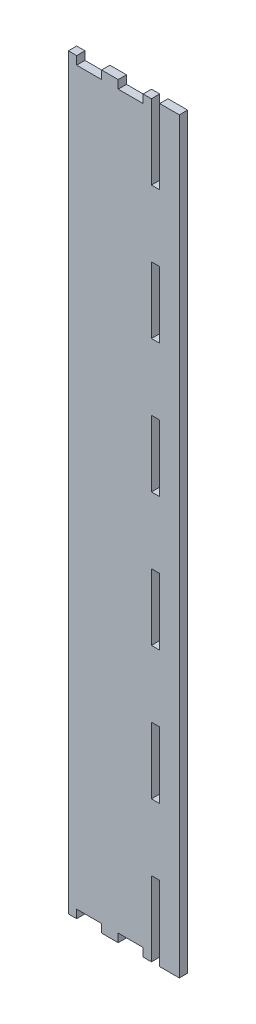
ISO-10303-21;
HEADER;
FILE_DESCRIPTION(('STEP AP214'),'2;1');
FILE_NAME('part.step','',(''),(''),'','','');
FILE_SCHEMA(('AUTOMOTIVE_DESIGN { 1 0 10303 214 1 1 1 1 }'));
ENDSEC;
DATA;
#1=APPLICATION_CONTEXT('core data for automotive mechanical design processes');
#2=APPLICATION_PROTOCOL_DEFINITION('international standard','automotive_design',2000,#1);
#3=PRODUCT_CONTEXT('',#1,'mechanical');
#4=PRODUCT('Part','Part','',(#3));
#5=PRODUCT_RELATED_PRODUCT_CATEGORY('part','',(#4));
#6=PRODUCT_DEFINITION_FORMATION('','',#4);
#7=PRODUCT_DEFINITION_CONTEXT('part definition',#1,'design');
#8=PRODUCT_DEFINITION('design','',#6,#7);
#9=PRODUCT_DEFINITION_SHAPE('','',#8);
#10=(LENGTH_UNIT() NAMED_UNIT(*) SI_UNIT(.MILLI.,.METRE.));
#11=(NAMED_UNIT(*) PLANE_ANGLE_UNIT() SI_UNIT($,.RADIAN.));
#12=(NAMED_UNIT(*) SI_UNIT($,.STERADIAN.) SOLID_ANGLE_UNIT());
#13=UNCERTAINTY_MEASURE_WITH_UNIT(LENGTH_MEASURE(1.E-05),#10,'distance_accuracy_value','');
#14=(GEOMETRIC_REPRESENTATION_CONTEXT(3) GLOBAL_UNCERTAINTY_ASSIGNED_CONTEXT((#13)) GLOBAL_UNIT_ASSIGNED_CONTEXT((#10,
#11,#12)) REPRESENTATION_CONTEXT('',''));
#15=CARTESIAN_POINT('',(0.,0.,0.));
#16=DIRECTION('',(0.,0.,1.));
#17=DIRECTION('',(1.,0.,0.));
#18=AXIS2_PLACEMENT_3D('',#15,#16,#17);
#19=CARTESIAN_POINT('',(0.,0.,5.));
#20=DIRECTION('',(0.,0.,-1.));
#21=DIRECTION('',(-1.,0.,0.));
#22=AXIS2_PLACEMENT_3D('',#19,#20,#21);
#23=PLANE('',#22);
#24=DIRECTION('',(-1.,0.,0.));
#25=VECTOR('',#24,1.);
#26=CARTESIAN_POINT('',(191.6856945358,41.341782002,5.));
#27=LINE('',#26,#25);
#28=CARTESIAN_POINT('',(191.6856945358,41.341782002,5.));
#29=VERTEX_POINT('',#28);
#30=CARTESIAN_POINT('',(186.6856945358,41.341782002,5.));
#31=VERTEX_POINT('',#30);
#32=EDGE_CURVE('E373',#29,#31,#27,.T.);
#33=ORIENTED_EDGE('',*,*,#32,.F.);
#34=DIRECTION('',(0.,1.,0.));
#35=VECTOR('',#34,1.);
#36=CARTESIAN_POINT('',(191.6856945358,1.341782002,5.));
#37=LINE('',#36,#35);
#38=CARTESIAN_POINT('',(191.6856945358,1.341782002,5.));
#39=VERTEX_POINT('',#38);
#40=EDGE_CURVE('E384',#39,#29,#37,.T.);
#41=ORIENTED_EDGE('',*,*,#40,.F.);
#42=DIRECTION('',(1.,0.,0.));
#43=VECTOR('',#42,1.);
#44=CARTESIAN_POINT('',(186.6856945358,1.341782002,5.));
#45=LINE('',#44,#43);
#46=CARTESIAN_POINT('',(186.6856945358,1.341782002,5.));
#47=VERTEX_POINT('',#46);
#48=EDGE_CURVE('E380',#47,#39,#45,.T.);
#49=ORIENTED_EDGE('',*,*,#48,.F.);
#50=DIRECTION('',(0.,-1.,0.));
#51=VECTOR('',#50,1.);
#52=CARTESIAN_POINT('',(186.6856945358,41.341782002,5.));
#53=LINE('',#52,#51);
#54=EDGE_CURVE('E376',#31,#47,#53,.T.);
#55=ORIENTED_EDGE('',*,*,#54,.F.);
#56=EDGE_LOOP('',(#33,#41,#49,#55));
#57=FACE_BOUND('',#56,.T.);
#58=DIRECTION('',(-1.,0.,0.));
#59=VECTOR('',#58,1.);
#60=CARTESIAN_POINT('',(191.6856945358,-118.658217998,5.));
#61=LINE('',#60,#59);
#62=CARTESIAN_POINT('',(191.6856945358,-118.658217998,5.));
#63=VERTEX_POINT('',#62);
#64=CARTESIAN_POINT('',(186.6856945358,-118.658217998,5.));
#65=VERTEX_POINT('',#64);
#66=EDGE_CURVE('E459',#63,#65,#61,.T.);
#67=ORIENTED_EDGE('',*,*,#66,.F.);
#68=DIRECTION('',(0.,1.,0.));
#69=VECTOR('',#68,1.);
#70=CARTESIAN_POINT('',(191.6856945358,-158.658217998,5.));
#71=LINE('',#70,#69);
#72=CARTESIAN_POINT('',(191.6856945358,-158.658217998,5.));
#73=VERTEX_POINT('',#72);
#74=EDGE_CURVE('E470',#73,#63,#71,.T.);
#75=ORIENTED_EDGE('',*,*,#74,.F.);
#76=DIRECTION('',(1.,0.,0.));
#77=VECTOR('',#76,1.);
#78=CARTESIAN_POINT('',(186.6856945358,-158.658217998,5.));
#79=LINE('',#78,#77);
#80=CARTESIAN_POINT('',(186.6856945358,-158.658217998,5.));
#81=VERTEX_POINT('',#80);
#82=EDGE_CURVE('E466',#81,#73,#79,.T.);
#83=ORIENTED_EDGE('',*,*,#82,.F.);
#84=DIRECTION('',(0.,-1.,0.));
#85=VECTOR('',#84,1.);
#86=CARTESIAN_POINT('',(186.6856945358,-118.658217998,5.));
#87=LINE('',#86,#85);
#88=EDGE_CURVE('E462',#65,#81,#87,.T.);
#89=ORIENTED_EDGE('',*,*,#88,.F.);
#90=EDGE_LOOP('',(#67,#75,#83,#89));
#91=FACE_BOUND('',#90,.T.);
#92=DIRECTION('',(1.,0.,0.));
#93=VECTOR('',#92,1.);
#94=CARTESIAN_POINT('',(166.6856945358,-243.658217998,5.));
#95=LINE('',#94,#93);
#96=CARTESIAN_POINT('',(156.6856945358,-243.658217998,5.));
#97=VERTEX_POINT('',#96);
#98=CARTESIAN_POINT('',(166.6856945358,-243.658217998,5.));
#99=VERTEX_POINT('',#98);
#100=EDGE_CURVE('E502',#97,#99,#95,.T.);
#101=ORIENTED_EDGE('',*,*,#100,.T.);
#102=DIRECTION('',(0.,1.,0.));
#103=VECTOR('',#102,1.);
#104=CARTESIAN_POINT('',(166.6856945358,-238.658217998,5.));
#105=LINE('',#104,#103);
#106=CARTESIAN_POINT('',(166.6856945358,-238.658217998,5.));
#107=VERTEX_POINT('',#106);
#108=EDGE_CURVE('E506',#99,#107,#105,.T.);
#109=ORIENTED_EDGE('',*,*,#108,.T.);
#110=DIRECTION('',(1.,0.,0.));
#111=VECTOR('',#110,1.);
#112=CARTESIAN_POINT('',(181.6856945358,-238.658217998,5.));
#113=LINE('',#112,#111);
#114=CARTESIAN_POINT('',(181.6856945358,-238.658217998,5.));
#115=VERTEX_POINT('',#114);
#116=EDGE_CURVE('E510',#107,#115,#113,.T.);
#117=ORIENTED_EDGE('',*,*,#116,.T.);
#118=DIRECTION('',(0.,-1.,0.));
#119=VECTOR('',#118,1.);
#120=CARTESIAN_POINT('',(181.6856945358,-243.658217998,5.));
#121=LINE('',#120,#119);
#122=CARTESIAN_POINT('',(181.6856945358,-243.658217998,5.));
#123=VERTEX_POINT('',#122);
#124=EDGE_CURVE('E513',#115,#123,#121,.T.);
#125=ORIENTED_EDGE('',*,*,#124,.T.);
#126=DIRECTION('',(1.,0.,0.));
#127=VECTOR('',#126,1.);
#128=CARTESIAN_POINT('',(186.6856945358,-243.658217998,5.));
#129=LINE('',#128,#127);
#130=CARTESIAN_POINT('',(186.6856945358,-243.658217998,5.));
#131=VERTEX_POINT('',#130);
#132=EDGE_CURVE('E516',#123,#131,#129,.T.);
#133=ORIENTED_EDGE('',*,*,#132,.T.);
#134=DIRECTION('',(0.,1.,0.));
#135=VECTOR('',#134,1.);
#136=CARTESIAN_POINT('',(186.6856945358,-198.658217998,5.));
#137=LINE('',#136,#135);
#138=CARTESIAN_POINT('',(186.6856945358,-198.658217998,5.));
#139=VERTEX_POINT('',#138);
#140=EDGE_CURVE('E519',#131,#139,#137,.T.);
#141=ORIENTED_EDGE('',*,*,#140,.T.);
#142=DIRECTION('',(1.,0.,0.));
#143=VECTOR('',#142,1.);
#144=CARTESIAN_POINT('',(191.6856945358,-198.658217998,5.));
#145=LINE('',#144,#143);
#146=CARTESIAN_POINT('',(191.6856945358,-198.658217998,5.));
#147=VERTEX_POINT('',#146);
#148=EDGE_CURVE('E522',#139,#147,#145,.T.);
#149=ORIENTED_EDGE('',*,*,#148,.T.);
#150=DIRECTION('',(0.,-1.,0.));
#151=VECTOR('',#150,1.);
#152=CARTESIAN_POINT('',(191.6856945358,-243.658217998,5.));
#153=LINE('',#152,#151);
#154=CARTESIAN_POINT('',(191.6856945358,-243.658217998,5.));
#155=VERTEX_POINT('',#154);
#156=EDGE_CURVE('E525',#147,#155,#153,.T.);
#157=ORIENTED_EDGE('',*,*,#156,.T.);
#158=DIRECTION('',(1.,0.,0.));
#159=VECTOR('',#158,1.);
#160=CARTESIAN_POINT('',(203.4867181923,-243.658217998,5.));
#161=LINE('',#160,#159);
#162=CARTESIAN_POINT('',(203.4867181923,-243.658217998,5.));
#163=VERTEX_POINT('',#162);
#164=EDGE_CURVE('E528',#155,#163,#161,.T.);
#165=ORIENTED_EDGE('',*,*,#164,.T.);
#166=DIRECTION('',(0.,1.,0.));
#167=VECTOR('',#166,1.);
#168=CARTESIAN_POINT('',(203.4867181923,206.341782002,5.));
#169=LINE('',#168,#167);
#170=CARTESIAN_POINT('',(203.4867181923,206.341782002,5.));
#171=VERTEX_POINT('',#170);
#172=EDGE_CURVE('E531',#163,#171,#169,.T.);
#173=ORIENTED_EDGE('',*,*,#172,.T.);
#174=DIRECTION('',(-1.,0.,0.));
#175=VECTOR('',#174,1.);
#176=CARTESIAN_POINT('',(203.4867181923,206.341782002,5.));
#177=LINE('',#176,#175);
#178=CARTESIAN_POINT('',(191.6856945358,206.341782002,5.));
#179=VERTEX_POINT('',#178);
#180=EDGE_CURVE('E534',#171,#179,#177,.T.);
#181=ORIENTED_EDGE('',*,*,#180,.T.);
#182=DIRECTION('',(0.,-1.,0.));
#183=VECTOR('',#182,1.);
#184=CARTESIAN_POINT('',(191.6856945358,161.341782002,5.));
#185=LINE('',#184,#183);
#186=CARTESIAN_POINT('',(191.6856945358,161.341782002,5.));
#187=VERTEX_POINT('',#186);
#188=EDGE_CURVE('E537',#179,#187,#185,.T.);
#189=ORIENTED_EDGE('',*,*,#188,.T.);
#190=DIRECTION('',(-1.,0.,0.));
#191=VECTOR('',#190,1.);
#192=CARTESIAN_POINT('',(186.6856945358,161.341782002,5.));
#193=LINE('',#192,#191);
#194=CARTESIAN_POINT('',(186.6856945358,161.341782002,5.));
#195=VERTEX_POINT('',#194);
#196=EDGE_CURVE('E540',#187,#195,#193,.T.);
#197=ORIENTED_EDGE('',*,*,#196,.T.);
#198=DIRECTION('',(0.,1.,0.));
#199=VECTOR('',#198,1.);
#200=CARTESIAN_POINT('',(186.6856945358,161.341782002,5.));
#201=LINE('',#200,#199);
#202=CARTESIAN_POINT('',(186.6856945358,206.341782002,5.));
#203=VERTEX_POINT('',#202);
#204=EDGE_CURVE('E543',#195,#203,#201,.T.);
#205=ORIENTED_EDGE('',*,*,#204,.T.);
#206=DIRECTION('',(-1.,0.,0.));
#207=VECTOR('',#206,1.);
#208=CARTESIAN_POINT('',(186.6856945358,206.341782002,5.));
#209=LINE('',#208,#207);
#210=CARTESIAN_POINT('',(181.6856945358,206.341782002,5.));
#211=VERTEX_POINT('',#210);
#212=EDGE_CURVE('E546',#203,#211,#209,.T.);
#213=ORIENTED_EDGE('',*,*,#212,.T.);
#214=DIRECTION('',(0.,-1.,0.));
#215=VECTOR('',#214,1.);
#216=CARTESIAN_POINT('',(181.6856945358,206.341782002,5.));
#217=LINE('',#216,#215);
#218=CARTESIAN_POINT('',(181.6856945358,201.341782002,5.));
#219=VERTEX_POINT('',#218);
#220=EDGE_CURVE('E549',#211,#219,#217,.T.);
#221=ORIENTED_EDGE('',*,*,#220,.T.);
#222=DIRECTION('',(-1.,0.,0.));
#223=VECTOR('',#222,1.);
#224=CARTESIAN_POINT('',(166.6856945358,201.341782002,5.));
#225=LINE('',#224,#223);
#226=CARTESIAN_POINT('',(166.6856945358,201.341782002,5.));
#227=VERTEX_POINT('',#226);
#228=EDGE_CURVE('E552',#219,#227,#225,.T.);
#229=ORIENTED_EDGE('',*,*,#228,.T.);
#230=DIRECTION('',(0.,1.,0.));
#231=VECTOR('',#230,1.);
#232=CARTESIAN_POINT('',(166.6856945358,201.341782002,5.));
#233=LINE('',#232,#231);
#234=CARTESIAN_POINT('',(166.6856945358,206.341782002,5.));
#235=VERTEX_POINT('',#234);
#236=EDGE_CURVE('E555',#227,#235,#233,.T.);
#237=ORIENTED_EDGE('',*,*,#236,.T.);
#238=DIRECTION('',(-1.,0.,0.));
#239=VECTOR('',#238,1.);
#240=CARTESIAN_POINT('',(166.6856945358,206.341782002,5.));
#241=LINE('',#240,#239);
#242=CARTESIAN_POINT('',(156.6856945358,206.341782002,5.));
#243=VERTEX_POINT('',#242);
#244=EDGE_CURVE('E558',#235,#243,#241,.T.);
#245=ORIENTED_EDGE('',*,*,#244,.T.);
#246=DIRECTION('',(0.,-1.,0.));
#247=VECTOR('',#246,1.);
#248=CARTESIAN_POINT('',(156.6856945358,206.341782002,5.));
#249=LINE('',#248,#247);
#250=CARTESIAN_POINT('',(156.6856945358,201.341782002,5.));
#251=VERTEX_POINT('',#250);
#252=EDGE_CURVE('E561',#243,#251,#249,.T.);
#253=ORIENTED_EDGE('',*,*,#252,.T.);
#254=DIRECTION('',(-1.,0.,0.));
#255=VECTOR('',#254,1.);
#256=CARTESIAN_POINT('',(156.6856945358,201.341782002,5.));
#257=LINE('',#256,#255);
#258=CARTESIAN_POINT('',(141.6856945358,201.341782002,5.));
#259=VERTEX_POINT('',#258);
#260=EDGE_CURVE('E564',#251,#259,#257,.T.);
#261=ORIENTED_EDGE('',*,*,#260,.T.);
#262=DIRECTION('',(0.,1.,0.));
#263=VECTOR('',#262,1.);
#264=CARTESIAN_POINT('',(141.6856945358,201.341782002,5.));
#265=LINE('',#264,#263);
#266=CARTESIAN_POINT('',(141.6856945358,206.341782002,5.));
#267=VERTEX_POINT('',#266);
#268=EDGE_CURVE('E567',#259,#267,#265,.T.);
#269=ORIENTED_EDGE('',*,*,#268,.T.);
#270=DIRECTION('',(-1.,0.,0.));
#271=VECTOR('',#270,1.);
#272=CARTESIAN_POINT('',(141.6856945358,206.341782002,5.));
#273=LINE('',#272,#271);
#274=CARTESIAN_POINT('',(136.6856945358,206.341782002,5.));
#275=VERTEX_POINT('',#274);
#276=EDGE_CURVE('E570',#267,#275,#273,.T.);
#277=ORIENTED_EDGE('',*,*,#276,.T.);
#278=DIRECTION('',(0.,-1.,0.));
#279=VECTOR('',#278,1.);
#280=CARTESIAN_POINT('',(136.6856945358,206.341782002,5.));
#281=LINE('',#280,#279);
#282=CARTESIAN_POINT('',(136.6856945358,-243.658217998,5.));
#283=VERTEX_POINT('',#282);
#284=EDGE_CURVE('E573',#275,#283,#281,.T.);
#285=ORIENTED_EDGE('',*,*,#284,.T.);
#286=DIRECTION('',(1.,0.,0.));
#287=VECTOR('',#286,1.);
#288=CARTESIAN_POINT('',(141.6856945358,-243.658217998,5.));
#289=LINE('',#288,#287);
#290=CARTESIAN_POINT('',(141.6856945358,-243.658217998,5.));
#291=VERTEX_POINT('',#290);
#292=EDGE_CURVE('E576',#283,#291,#289,.T.);
#293=ORIENTED_EDGE('',*,*,#292,.T.);
#294=DIRECTION('',(0.,1.,0.));
#295=VECTOR('',#294,1.);
#296=CARTESIAN_POINT('',(141.6856945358,-238.658217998,5.));
#297=LINE('',#296,#295);
#298=CARTESIAN_POINT('',(141.6856945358,-238.658217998,5.));
#299=VERTEX_POINT('',#298);
#300=EDGE_CURVE('E579',#291,#299,#297,.T.);
#301=ORIENTED_EDGE('',*,*,#300,.T.);
#302=DIRECTION('',(1.,0.,0.));
#303=VECTOR('',#302,1.);
#304=CARTESIAN_POINT('',(156.6856945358,-238.658217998,5.));
#305=LINE('',#304,#303);
#306=CARTESIAN_POINT('',(156.6856945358,-238.658217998,5.));
#307=VERTEX_POINT('',#306);
#308=EDGE_CURVE('E582',#299,#307,#305,.T.);
#309=ORIENTED_EDGE('',*,*,#308,.T.);
#310=DIRECTION('',(0.,-1.,0.));
#311=VECTOR('',#310,1.);
#312=CARTESIAN_POINT('',(156.6856945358,-243.658217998,5.));
#313=LINE('',#312,#311);
#314=EDGE_CURVE('E585',#307,#97,#313,.T.);
#315=ORIENTED_EDGE('',*,*,#314,.T.);
#316=EDGE_LOOP('',(#101,#109,#117,#125,#133,#141,#149,#157,#165,#173,#181,#189,#197,#205,#213,
#221,#229,#237,#245,#253,#261,#269,#277,#285,#293,#301,#309,#315));
#317=FACE_BOUND('',#316,.T.);
#318=DIRECTION('',(-1.,0.,0.));
#319=VECTOR('',#318,1.);
#320=CARTESIAN_POINT('',(191.6856945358,121.341782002,5.));
#321=LINE('',#320,#319);
#322=CARTESIAN_POINT('',(191.6856945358,121.341782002,5.));
#323=VERTEX_POINT('',#322);
#324=CARTESIAN_POINT('',(186.6856945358,121.341782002,5.));
#325=VERTEX_POINT('',#324);
#326=EDGE_CURVE('E416',#323,#325,#321,.T.);
#327=ORIENTED_EDGE('',*,*,#326,.F.);
#328=DIRECTION('',(0.,1.,0.));
#329=VECTOR('',#328,1.);
#330=CARTESIAN_POINT('',(191.6856945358,81.341782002,5.));
#331=LINE('',#330,#329);
#332=CARTESIAN_POINT('',(191.6856945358,81.341782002,5.));
#333=VERTEX_POINT('',#332);
#334=EDGE_CURVE('E427',#333,#323,#331,.T.);
#335=ORIENTED_EDGE('',*,*,#334,.F.);
#336=DIRECTION('',(1.,0.,0.));
#337=VECTOR('',#336,1.);
#338=CARTESIAN_POINT('',(186.6856945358,81.341782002,5.));
#339=LINE('',#338,#337);
#340=CARTESIAN_POINT('',(186.6856945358,81.341782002,5.));
#341=VERTEX_POINT('',#340);
#342=EDGE_CURVE('E423',#341,#333,#339,.T.);
#343=ORIENTED_EDGE('',*,*,#342,.F.);
#344=DIRECTION('',(0.,-1.,0.));
#345=VECTOR('',#344,1.);
#346=CARTESIAN_POINT('',(186.6856945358,121.341782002,5.));
#347=LINE('',#346,#345);
#348=EDGE_CURVE('E419',#325,#341,#347,.T.);
#349=ORIENTED_EDGE('',*,*,#348,.F.);
#350=EDGE_LOOP('',(#327,#335,#343,#349));
#351=FACE_BOUND('',#350,.T.);
#352=DIRECTION('',(-1.,0.,0.));
#353=VECTOR('',#352,1.);
#354=CARTESIAN_POINT('',(191.6856945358,-38.658217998,5.));
#355=LINE('',#354,#353);
#356=CARTESIAN_POINT('',(191.6856945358,-38.658217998,5.));
#357=VERTEX_POINT('',#356);
#358=CARTESIAN_POINT('',(186.6856945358,-38.658217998,5.));
#359=VERTEX_POINT('',#358);
#360=EDGE_CURVE('E325',#357,#359,#355,.T.);
#361=ORIENTED_EDGE('',*,*,#360,.F.);
#362=DIRECTION('',(0.,1.,0.));
#363=VECTOR('',#362,1.);
#364=CARTESIAN_POINT('',(191.6856945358,-78.658217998,5.));
#365=LINE('',#364,#363);
#366=CARTESIAN_POINT('',(191.6856945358,-78.658217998,5.));
#367=VERTEX_POINT('',#366);
#368=EDGE_CURVE('E351',#367,#357,#365,.T.);
#369=ORIENTED_EDGE('',*,*,#368,.F.);
#370=DIRECTION('',(1.,0.,0.));
#371=VECTOR('',#370,1.);
#372=CARTESIAN_POINT('',(186.6856945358,-78.658217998,5.));
#373=LINE('',#372,#371);
#374=CARTESIAN_POINT('',(186.6856945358,-78.658217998,5.));
#375=VERTEX_POINT('',#374);
#376=EDGE_CURVE('E347',#375,#367,#373,.T.);
#377=ORIENTED_EDGE('',*,*,#376,.F.);
#378=DIRECTION('',(0.,-1.,0.));
#379=VECTOR('',#378,1.);
#380=CARTESIAN_POINT('',(186.6856945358,-38.658217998,5.));
#381=LINE('',#380,#379);
#382=EDGE_CURVE('E334',#359,#375,#381,.T.);
#383=ORIENTED_EDGE('',*,*,#382,.F.);
#384=EDGE_LOOP('',(#361,#369,#377,#383));
#385=FACE_BOUND('',#384,.T.);
#386=ADVANCED_FACE('F43',(#57,#91,#317,#351,#385),#23,.F.);
#387=CARTESIAN_POINT('',(0.,0.,0.));
#388=DIRECTION('',(0.,0.,-1.));
#389=DIRECTION('',(-1.,0.,0.));
#390=AXIS2_PLACEMENT_3D('',#387,#388,#389);
#391=PLANE('',#390);
#392=DIRECTION('',(1.,0.,0.));
#393=VECTOR('',#392,1.);
#394=CARTESIAN_POINT('',(166.6856945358,-243.658217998,0.));
#395=LINE('',#394,#393);
#396=CARTESIAN_POINT('',(156.6856945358,-243.658217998,0.));
#397=VERTEX_POINT('',#396);
#398=CARTESIAN_POINT('',(166.6856945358,-243.658217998,0.));
#399=VERTEX_POINT('',#398);
#400=EDGE_CURVE('E501',#397,#399,#395,.T.);
#401=ORIENTED_EDGE('',*,*,#400,.F.);
#402=DIRECTION('',(0.,-1.,0.));
#403=VECTOR('',#402,1.);
#404=CARTESIAN_POINT('',(156.6856945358,-243.658217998,0.));
#405=LINE('',#404,#403);
#406=CARTESIAN_POINT('',(156.6856945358,-238.658217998,0.));
#407=VERTEX_POINT('',#406);
#408=EDGE_CURVE('E507',#407,#397,#405,.T.);
#409=ORIENTED_EDGE('',*,*,#408,.F.);
#410=DIRECTION('',(1.,0.,0.));
#411=VECTOR('',#410,1.);
#412=CARTESIAN_POINT('',(156.6856945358,-238.658217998,0.));
#413=LINE('',#412,#411);
#414=CARTESIAN_POINT('',(141.6856945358,-238.658217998,0.));
#415=VERTEX_POINT('',#414);
#416=EDGE_CURVE('E667',#415,#407,#413,.T.);
#417=ORIENTED_EDGE('',*,*,#416,.F.);
#418=DIRECTION('',(0.,1.,0.));
#419=VECTOR('',#418,1.);
#420=CARTESIAN_POINT('',(141.6856945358,-238.658217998,0.));
#421=LINE('',#420,#419);
#422=CARTESIAN_POINT('',(141.6856945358,-243.658217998,0.));
#423=VERTEX_POINT('',#422);
#424=EDGE_CURVE('E664',#423,#415,#421,.T.);
#425=ORIENTED_EDGE('',*,*,#424,.F.);
#426=DIRECTION('',(1.,0.,0.));
#427=VECTOR('',#426,1.);
#428=CARTESIAN_POINT('',(141.6856945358,-243.658217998,0.));
#429=LINE('',#428,#427);
#430=CARTESIAN_POINT('',(136.6856945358,-243.658217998,0.));
#431=VERTEX_POINT('',#430);
#432=EDGE_CURVE('E661',#431,#423,#429,.T.);
#433=ORIENTED_EDGE('',*,*,#432,.F.);
#434=DIRECTION('',(0.,-1.,0.));
#435=VECTOR('',#434,1.);
#436=CARTESIAN_POINT('',(136.6856945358,206.341782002,0.));
#437=LINE('',#436,#435);
#438=CARTESIAN_POINT('',(136.6856945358,206.341782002,0.));
#439=VERTEX_POINT('',#438);
#440=EDGE_CURVE('E658',#439,#431,#437,.T.);
#441=ORIENTED_EDGE('',*,*,#440,.F.);
#442=DIRECTION('',(-1.,0.,0.));
#443=VECTOR('',#442,1.);
#444=CARTESIAN_POINT('',(141.6856945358,206.341782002,0.));
#445=LINE('',#444,#443);
#446=CARTESIAN_POINT('',(141.6856945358,206.341782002,0.));
#447=VERTEX_POINT('',#446);
#448=EDGE_CURVE('E655',#447,#439,#445,.T.);
#449=ORIENTED_EDGE('',*,*,#448,.F.);
#450=DIRECTION('',(0.,1.,0.));
#451=VECTOR('',#450,1.);
#452=CARTESIAN_POINT('',(141.6856945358,201.341782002,0.));
#453=LINE('',#452,#451);
#454=CARTESIAN_POINT('',(141.6856945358,201.341782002,0.));
#455=VERTEX_POINT('',#454);
#456=EDGE_CURVE('E652',#455,#447,#453,.T.);
#457=ORIENTED_EDGE('',*,*,#456,.F.);
#458=DIRECTION('',(-1.,0.,0.));
#459=VECTOR('',#458,1.);
#460=CARTESIAN_POINT('',(156.6856945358,201.341782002,0.));
#461=LINE('',#460,#459);
#462=CARTESIAN_POINT('',(156.6856945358,201.341782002,0.));
#463=VERTEX_POINT('',#462);
#464=EDGE_CURVE('E649',#463,#455,#461,.T.);
#465=ORIENTED_EDGE('',*,*,#464,.F.);
#466=DIRECTION('',(0.,-1.,0.));
#467=VECTOR('',#466,1.);
#468=CARTESIAN_POINT('',(156.6856945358,206.341782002,0.));
#469=LINE('',#468,#467);
#470=CARTESIAN_POINT('',(156.6856945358,206.341782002,0.));
#471=VERTEX_POINT('',#470);
#472=EDGE_CURVE('E646',#471,#463,#469,.T.);
#473=ORIENTED_EDGE('',*,*,#472,.F.);
#474=DIRECTION('',(-1.,0.,0.));
#475=VECTOR('',#474,1.);
#476=CARTESIAN_POINT('',(166.6856945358,206.341782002,0.));
#477=LINE('',#476,#475);
#478=CARTESIAN_POINT('',(166.6856945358,206.341782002,0.));
#479=VERTEX_POINT('',#478);
#480=EDGE_CURVE('E643',#479,#471,#477,.T.);
#481=ORIENTED_EDGE('',*,*,#480,.F.);
#482=DIRECTION('',(0.,1.,0.));
#483=VECTOR('',#482,1.);
#484=CARTESIAN_POINT('',(166.6856945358,201.341782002,0.));
#485=LINE('',#484,#483);
#486=CARTESIAN_POINT('',(166.6856945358,201.341782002,0.));
#487=VERTEX_POINT('',#486);
#488=EDGE_CURVE('E640',#487,#479,#485,.T.);
#489=ORIENTED_EDGE('',*,*,#488,.F.);
#490=DIRECTION('',(-1.,0.,0.));
#491=VECTOR('',#490,1.);
#492=CARTESIAN_POINT('',(166.6856945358,201.341782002,0.));
#493=LINE('',#492,#491);
#494=CARTESIAN_POINT('',(181.6856945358,201.341782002,0.));
#495=VERTEX_POINT('',#494);
#496=EDGE_CURVE('E637',#495,#487,#493,.T.);
#497=ORIENTED_EDGE('',*,*,#496,.F.);
#498=DIRECTION('',(0.,-1.,0.));
#499=VECTOR('',#498,1.);
#500=CARTESIAN_POINT('',(181.6856945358,206.341782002,0.));
#501=LINE('',#500,#499);
#502=CARTESIAN_POINT('',(181.6856945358,206.341782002,0.));
#503=VERTEX_POINT('',#502);
#504=EDGE_CURVE('E634',#503,#495,#501,.T.);
#505=ORIENTED_EDGE('',*,*,#504,.F.);
#506=DIRECTION('',(-1.,0.,0.));
#507=VECTOR('',#506,1.);
#508=CARTESIAN_POINT('',(186.6856945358,206.341782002,0.));
#509=LINE('',#508,#507);
#510=CARTESIAN_POINT('',(186.6856945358,206.341782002,0.));
#511=VERTEX_POINT('',#510);
#512=EDGE_CURVE('E631',#511,#503,#509,.T.);
#513=ORIENTED_EDGE('',*,*,#512,.F.);
#514=DIRECTION('',(0.,1.,0.));
#515=VECTOR('',#514,1.);
#516=CARTESIAN_POINT('',(186.6856945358,161.341782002,0.));
#517=LINE('',#516,#515);
#518=CARTESIAN_POINT('',(186.6856945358,161.341782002,0.));
#519=VERTEX_POINT('',#518);
#520=EDGE_CURVE('E628',#519,#511,#517,.T.);
#521=ORIENTED_EDGE('',*,*,#520,.F.);
#522=DIRECTION('',(-1.,0.,0.));
#523=VECTOR('',#522,1.);
#524=CARTESIAN_POINT('',(186.6856945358,161.341782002,0.));
#525=LINE('',#524,#523);
#526=CARTESIAN_POINT('',(191.6856945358,161.341782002,0.));
#527=VERTEX_POINT('',#526);
#528=EDGE_CURVE('E625',#527,#519,#525,.T.);
#529=ORIENTED_EDGE('',*,*,#528,.F.);
#530=DIRECTION('',(0.,-1.,0.));
#531=VECTOR('',#530,1.);
#532=CARTESIAN_POINT('',(191.6856945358,161.341782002,0.));
#533=LINE('',#532,#531);
#534=CARTESIAN_POINT('',(191.6856945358,206.341782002,0.));
#535=VERTEX_POINT('',#534);
#536=EDGE_CURVE('E622',#535,#527,#533,.T.);
#537=ORIENTED_EDGE('',*,*,#536,.F.);
#538=DIRECTION('',(-1.,0.,0.));
#539=VECTOR('',#538,1.);
#540=CARTESIAN_POINT('',(203.4867181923,206.341782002,0.));
#541=LINE('',#540,#539);
#542=CARTESIAN_POINT('',(203.4867181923,206.341782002,0.));
#543=VERTEX_POINT('',#542);
#544=EDGE_CURVE('E619',#543,#535,#541,.T.);
#545=ORIENTED_EDGE('',*,*,#544,.F.);
#546=DIRECTION('',(0.,1.,0.));
#547=VECTOR('',#546,1.);
#548=CARTESIAN_POINT('',(203.4867181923,206.341782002,0.));
#549=LINE('',#548,#547);
#550=CARTESIAN_POINT('',(203.4867181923,-243.658217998,0.));
#551=VERTEX_POINT('',#550);
#552=EDGE_CURVE('E616',#551,#543,#549,.T.);
#553=ORIENTED_EDGE('',*,*,#552,.F.);
#554=DIRECTION('',(1.,0.,0.));
#555=VECTOR('',#554,1.);
#556=CARTESIAN_POINT('',(203.4867181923,-243.658217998,0.));
#557=LINE('',#556,#555);
#558=CARTESIAN_POINT('',(191.6856945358,-243.658217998,0.));
#559=VERTEX_POINT('',#558);
#560=EDGE_CURVE('E613',#559,#551,#557,.T.);
#561=ORIENTED_EDGE('',*,*,#560,.F.);
#562=DIRECTION('',(0.,-1.,0.));
#563=VECTOR('',#562,1.);
#564=CARTESIAN_POINT('',(191.6856945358,-243.658217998,0.));
#565=LINE('',#564,#563);
#566=CARTESIAN_POINT('',(191.6856945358,-198.658217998,0.));
#567=VERTEX_POINT('',#566);
#568=EDGE_CURVE('E610',#567,#559,#565,.T.);
#569=ORIENTED_EDGE('',*,*,#568,.F.);
#570=DIRECTION('',(1.,0.,0.));
#571=VECTOR('',#570,1.);
#572=CARTESIAN_POINT('',(191.6856945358,-198.658217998,0.));
#573=LINE('',#572,#571);
#574=CARTESIAN_POINT('',(186.6856945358,-198.658217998,0.));
#575=VERTEX_POINT('',#574);
#576=EDGE_CURVE('E607',#575,#567,#573,.T.);
#577=ORIENTED_EDGE('',*,*,#576,.F.);
#578=DIRECTION('',(0.,1.,0.));
#579=VECTOR('',#578,1.);
#580=CARTESIAN_POINT('',(186.6856945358,-198.658217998,0.));
#581=LINE('',#580,#579);
#582=CARTESIAN_POINT('',(186.6856945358,-243.658217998,0.));
#583=VERTEX_POINT('',#582);
#584=EDGE_CURVE('E604',#583,#575,#581,.T.);
#585=ORIENTED_EDGE('',*,*,#584,.F.);
#586=DIRECTION('',(1.,0.,0.));
#587=VECTOR('',#586,1.);
#588=CARTESIAN_POINT('',(186.6856945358,-243.658217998,0.));
#589=LINE('',#588,#587);
#590=CARTESIAN_POINT('',(181.6856945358,-243.658217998,0.));
#591=VERTEX_POINT('',#590);
#592=EDGE_CURVE('E601',#591,#583,#589,.T.);
#593=ORIENTED_EDGE('',*,*,#592,.F.);
#594=DIRECTION('',(0.,-1.,0.));
#595=VECTOR('',#594,1.);
#596=CARTESIAN_POINT('',(181.6856945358,-243.658217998,0.));
#597=LINE('',#596,#595);
#598=CARTESIAN_POINT('',(181.6856945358,-238.658217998,0.));
#599=VERTEX_POINT('',#598);
#600=EDGE_CURVE('E598',#599,#591,#597,.T.);
#601=ORIENTED_EDGE('',*,*,#600,.F.);
#602=DIRECTION('',(1.,0.,0.));
#603=VECTOR('',#602,1.);
#604=CARTESIAN_POINT('',(181.6856945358,-238.658217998,0.));
#605=LINE('',#604,#603);
#606=CARTESIAN_POINT('',(166.6856945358,-238.658217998,0.));
#607=VERTEX_POINT('',#606);
#608=EDGE_CURVE('E595',#607,#599,#605,.T.);
#609=ORIENTED_EDGE('',*,*,#608,.F.);
#610=DIRECTION('',(0.,1.,0.));
#611=VECTOR('',#610,1.);
#612=CARTESIAN_POINT('',(166.6856945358,-238.658217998,0.));
#613=LINE('',#612,#611);
#614=EDGE_CURVE('E592',#399,#607,#613,.T.);
#615=ORIENTED_EDGE('',*,*,#614,.F.);
#616=EDGE_LOOP('',(#401,#409,#417,#425,#433,#441,#449,#457,#465,#473,#481,#489,#497,#505,#513,
#521,#529,#537,#545,#553,#561,#569,#577,#585,#593,#601,#609,#615));
#617=FACE_BOUND('',#616,.T.);
#618=DIRECTION('',(0.,1.,0.));
#619=VECTOR('',#618,1.);
#620=CARTESIAN_POINT('',(191.6856945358,-158.658217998,0.));
#621=LINE('',#620,#619);
#622=CARTESIAN_POINT('',(191.6856945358,-158.658217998,0.));
#623=VERTEX_POINT('',#622);
#624=CARTESIAN_POINT('',(191.6856945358,-118.658217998,0.));
#625=VERTEX_POINT('',#624);
#626=EDGE_CURVE('E463',#623,#625,#621,.T.);
#627=ORIENTED_EDGE('',*,*,#626,.T.);
#628=DIRECTION('',(-1.,0.,0.));
#629=VECTOR('',#628,1.);
#630=CARTESIAN_POINT('',(191.6856945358,-118.658217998,0.));
#631=LINE('',#630,#629);
#632=CARTESIAN_POINT('',(186.6856945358,-118.658217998,0.));
#633=VERTEX_POINT('',#632);
#634=EDGE_CURVE('E458',#625,#633,#631,.T.);
#635=ORIENTED_EDGE('',*,*,#634,.T.);
#636=DIRECTION('',(0.,-1.,0.));
#637=VECTOR('',#636,1.);
#638=CARTESIAN_POINT('',(186.6856945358,-118.658217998,0.));
#639=LINE('',#638,#637);
#640=CARTESIAN_POINT('',(186.6856945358,-158.658217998,0.));
#641=VERTEX_POINT('',#640);
#642=EDGE_CURVE('E477',#633,#641,#639,.T.);
#643=ORIENTED_EDGE('',*,*,#642,.T.);
#644=DIRECTION('',(1.,0.,0.));
#645=VECTOR('',#644,1.);
#646=CARTESIAN_POINT('',(186.6856945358,-158.658217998,0.));
#647=LINE('',#646,#645);
#648=EDGE_CURVE('E481',#641,#623,#647,.T.);
#649=ORIENTED_EDGE('',*,*,#648,.T.);
#650=EDGE_LOOP('',(#627,#635,#643,#649));
#651=FACE_BOUND('',#650,.T.);
#652=DIRECTION('',(0.,1.,0.));
#653=VECTOR('',#652,1.);
#654=CARTESIAN_POINT('',(191.6856945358,81.341782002,0.));
#655=LINE('',#654,#653);
#656=CARTESIAN_POINT('',(191.6856945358,81.341782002,0.));
#657=VERTEX_POINT('',#656);
#658=CARTESIAN_POINT('',(191.6856945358,121.341782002,0.));
#659=VERTEX_POINT('',#658);
#660=EDGE_CURVE('E420',#657,#659,#655,.T.);
#661=ORIENTED_EDGE('',*,*,#660,.T.);
#662=DIRECTION('',(-1.,0.,0.));
#663=VECTOR('',#662,1.);
#664=CARTESIAN_POINT('',(191.6856945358,121.341782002,0.));
#665=LINE('',#664,#663);
#666=CARTESIAN_POINT('',(186.6856945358,121.341782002,0.));
#667=VERTEX_POINT('',#666);
#668=EDGE_CURVE('E415',#659,#667,#665,.T.);
#669=ORIENTED_EDGE('',*,*,#668,.T.);
#670=DIRECTION('',(0.,-1.,0.));
#671=VECTOR('',#670,1.);
#672=CARTESIAN_POINT('',(186.6856945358,121.341782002,0.));
#673=LINE('',#672,#671);
#674=CARTESIAN_POINT('',(186.6856945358,81.341782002,0.));
#675=VERTEX_POINT('',#674);
#676=EDGE_CURVE('E434',#667,#675,#673,.T.);
#677=ORIENTED_EDGE('',*,*,#676,.T.);
#678=DIRECTION('',(1.,0.,0.));
#679=VECTOR('',#678,1.);
#680=CARTESIAN_POINT('',(186.6856945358,81.341782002,0.));
#681=LINE('',#680,#679);
#682=EDGE_CURVE('E438',#675,#657,#681,.T.);
#683=ORIENTED_EDGE('',*,*,#682,.T.);
#684=EDGE_LOOP('',(#661,#669,#677,#683));
#685=FACE_BOUND('',#684,.T.);
#686=DIRECTION('',(0.,1.,0.));
#687=VECTOR('',#686,1.);
#688=CARTESIAN_POINT('',(191.6856945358,1.341782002,0.));
#689=LINE('',#688,#687);
#690=CARTESIAN_POINT('',(191.6856945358,1.341782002,0.));
#691=VERTEX_POINT('',#690);
#692=CARTESIAN_POINT('',(191.6856945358,41.341782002,0.));
#693=VERTEX_POINT('',#692);
#694=EDGE_CURVE('E377',#691,#693,#689,.T.);
#695=ORIENTED_EDGE('',*,*,#694,.T.);
#696=DIRECTION('',(-1.,0.,0.));
#697=VECTOR('',#696,1.);
#698=CARTESIAN_POINT('',(191.6856945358,41.341782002,0.));
#699=LINE('',#698,#697);
#700=CARTESIAN_POINT('',(186.6856945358,41.341782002,0.));
#701=VERTEX_POINT('',#700);
#702=EDGE_CURVE('E343',#693,#701,#699,.T.);
#703=ORIENTED_EDGE('',*,*,#702,.T.);
#704=DIRECTION('',(0.,-1.,0.));
#705=VECTOR('',#704,1.);
#706=CARTESIAN_POINT('',(186.6856945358,41.341782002,0.));
#707=LINE('',#706,#705);
#708=CARTESIAN_POINT('',(186.6856945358,1.341782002,0.));
#709=VERTEX_POINT('',#708);
#710=EDGE_CURVE('E391',#701,#709,#707,.T.);
#711=ORIENTED_EDGE('',*,*,#710,.T.);
#712=DIRECTION('',(1.,0.,0.));
#713=VECTOR('',#712,1.);
#714=CARTESIAN_POINT('',(186.6856945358,1.341782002,0.));
#715=LINE('',#714,#713);
#716=EDGE_CURVE('E395',#709,#691,#715,.T.);
#717=ORIENTED_EDGE('',*,*,#716,.T.);
#718=EDGE_LOOP('',(#695,#703,#711,#717));
#719=FACE_BOUND('',#718,.T.);
#720=DIRECTION('',(0.,1.,0.));
#721=VECTOR('',#720,1.);
#722=CARTESIAN_POINT('',(191.6856945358,-78.658217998,0.));
#723=LINE('',#722,#721);
#724=CARTESIAN_POINT('',(191.6856945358,-78.658217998,0.));
#725=VERTEX_POINT('',#724);
#726=CARTESIAN_POINT('',(191.6856945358,-38.658217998,0.));
#727=VERTEX_POINT('',#726);
#728=EDGE_CURVE('E335',#725,#727,#723,.T.);
#729=ORIENTED_EDGE('',*,*,#728,.T.);
#730=DIRECTION('',(-1.,0.,0.));
#731=VECTOR('',#730,1.);
#732=CARTESIAN_POINT('',(191.6856945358,-38.658217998,0.));
#733=LINE('',#732,#731);
#734=CARTESIAN_POINT('',(186.6856945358,-38.658217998,0.));
#735=VERTEX_POINT('',#734);
#736=EDGE_CURVE('E67',#727,#735,#733,.T.);
#737=ORIENTED_EDGE('',*,*,#736,.T.);
#738=DIRECTION('',(0.,-1.,0.));
#739=VECTOR('',#738,1.);
#740=CARTESIAN_POINT('',(186.6856945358,-38.658217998,0.));
#741=LINE('',#740,#739);
#742=CARTESIAN_POINT('',(186.6856945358,-78.658217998,0.));
#743=VERTEX_POINT('',#742);
#744=EDGE_CURVE('E341',#735,#743,#741,.T.);
#745=ORIENTED_EDGE('',*,*,#744,.T.);
#746=DIRECTION('',(1.,0.,0.));
#747=VECTOR('',#746,1.);
#748=CARTESIAN_POINT('',(186.6856945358,-78.658217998,0.));
#749=LINE('',#748,#747);
#750=EDGE_CURVE('E360',#743,#725,#749,.T.);
#751=ORIENTED_EDGE('',*,*,#750,.T.);
#752=EDGE_LOOP('',(#729,#737,#745,#751));
#753=FACE_BOUND('',#752,.T.);
#754=ADVANCED_FACE('F786',(#617,#651,#685,#719,#753),#391,.T.);
#755=CARTESIAN_POINT('',(166.6856945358,-243.658217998,5.));
#756=DIRECTION('',(0.,1.,0.));
#757=DIRECTION('',(0.,0.,1.));
#758=AXIS2_PLACEMENT_3D('',#755,#756,#757);
#759=PLANE('',#758);
#760=ORIENTED_EDGE('',*,*,#400,.T.);
#761=DIRECTION('',(0.,0.,-1.));
#762=VECTOR('',#761,1.);
#763=CARTESIAN_POINT('',(166.6856945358,-243.658217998,5.));
#764=LINE('',#763,#762);
#765=EDGE_CURVE('E11',#99,#399,#764,.T.);
#766=ORIENTED_EDGE('',*,*,#765,.F.);
#767=ORIENTED_EDGE('',*,*,#100,.F.);
#768=DIRECTION('',(0.,0.,-1.));
#769=VECTOR('',#768,1.);
#770=CARTESIAN_POINT('',(156.6856945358,-243.658217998,5.));
#771=LINE('',#770,#769);
#772=EDGE_CURVE('E588',#97,#397,#771,.T.);
#773=ORIENTED_EDGE('',*,*,#772,.T.);
#774=EDGE_LOOP('',(#760,#766,#767,#773));
#775=FACE_BOUND('',#774,.T.);
#776=ADVANCED_FACE('F45',(#775),#759,.F.);
#777=CARTESIAN_POINT('',(166.6856945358,-238.658217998,5.));
#778=DIRECTION('',(-1.,0.,0.));
#779=DIRECTION('',(0.,0.,1.));
#780=AXIS2_PLACEMENT_3D('',#777,#778,#779);
#781=PLANE('',#780);
#782=ORIENTED_EDGE('',*,*,#614,.T.);
#783=DIRECTION('',(0.,0.,-1.));
#784=VECTOR('',#783,1.);
#785=CARTESIAN_POINT('',(166.6856945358,-238.658217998,5.));
#786=LINE('',#785,#784);
#787=EDGE_CURVE('E52',#107,#607,#786,.T.);
#788=ORIENTED_EDGE('',*,*,#787,.F.);
#789=ORIENTED_EDGE('',*,*,#108,.F.);
#790=ORIENTED_EDGE('',*,*,#765,.T.);
#791=EDGE_LOOP('',(#782,#788,#789,#790));
#792=FACE_BOUND('',#791,.T.);
#793=ADVANCED_FACE('F804',(#792),#781,.F.);
#794=CARTESIAN_POINT('',(181.6856945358,-238.658217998,5.));
#795=DIRECTION('',(0.,1.,0.));
#796=DIRECTION('',(0.,0.,1.));
#797=AXIS2_PLACEMENT_3D('',#794,#795,#796);
#798=PLANE('',#797);
#799=ORIENTED_EDGE('',*,*,#608,.T.);
#800=DIRECTION('',(0.,0.,-1.));
#801=VECTOR('',#800,1.);
#802=CARTESIAN_POINT('',(181.6856945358,-238.658217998,5.));
#803=LINE('',#802,#801);
#804=EDGE_CURVE('E771',#115,#599,#803,.T.);
#805=ORIENTED_EDGE('',*,*,#804,.F.);
#806=ORIENTED_EDGE('',*,*,#116,.F.);
#807=ORIENTED_EDGE('',*,*,#787,.T.);
#808=EDGE_LOOP('',(#799,#805,#806,#807));
#809=FACE_BOUND('',#808,.T.);
#810=ADVANCED_FACE('F780',(#809),#798,.F.);
#811=CARTESIAN_POINT('',(181.6856945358,-243.658217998,5.));
#812=DIRECTION('',(1.,0.,0.));
#813=DIRECTION('',(0.,0.,-1.));
#814=AXIS2_PLACEMENT_3D('',#811,#812,#813);
#815=PLANE('',#814);
#816=ORIENTED_EDGE('',*,*,#600,.T.);
#817=DIRECTION('',(0.,0.,-1.));
#818=VECTOR('',#817,1.);
#819=CARTESIAN_POINT('',(181.6856945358,-243.658217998,5.));
#820=LINE('',#819,#818);
#821=EDGE_CURVE('E767',#123,#591,#820,.T.);
#822=ORIENTED_EDGE('',*,*,#821,.F.);
#823=ORIENTED_EDGE('',*,*,#124,.F.);
#824=ORIENTED_EDGE('',*,*,#804,.T.);
#825=EDGE_LOOP('',(#816,#822,#823,#824));
#826=FACE_BOUND('',#825,.T.);
#827=ADVANCED_FACE('F792',(#826),#815,.F.);
#828=CARTESIAN_POINT('',(186.6856945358,-243.658217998,5.));
#829=DIRECTION('',(0.,1.,0.));
#830=DIRECTION('',(0.,0.,1.));
#831=AXIS2_PLACEMENT_3D('',#828,#829,#830);
#832=PLANE('',#831);
#833=ORIENTED_EDGE('',*,*,#592,.T.);
#834=DIRECTION('',(0.,0.,-1.));
#835=VECTOR('',#834,1.);
#836=CARTESIAN_POINT('',(186.6856945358,-243.658217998,5.));
#837=LINE('',#836,#835);
#838=EDGE_CURVE('E763',#131,#583,#837,.T.);
#839=ORIENTED_EDGE('',*,*,#838,.F.);
#840=ORIENTED_EDGE('',*,*,#132,.F.);
#841=ORIENTED_EDGE('',*,*,#821,.T.);
#842=EDGE_LOOP('',(#833,#839,#840,#841));
#843=FACE_BOUND('',#842,.T.);
#844=ADVANCED_FACE('F796',(#843),#832,.F.);
#845=CARTESIAN_POINT('',(186.6856945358,-198.658217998,5.));
#846=DIRECTION('',(-1.,0.,0.));
#847=DIRECTION('',(0.,0.,1.));
#848=AXIS2_PLACEMENT_3D('',#845,#846,#847);
#849=PLANE('',#848);
#850=ORIENTED_EDGE('',*,*,#584,.T.);
#851=DIRECTION('',(0.,0.,-1.));
#852=VECTOR('',#851,1.);
#853=CARTESIAN_POINT('',(186.6856945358,-198.658217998,5.));
#854=LINE('',#853,#852);
#855=EDGE_CURVE('E759',#139,#575,#854,.T.);
#856=ORIENTED_EDGE('',*,*,#855,.F.);
#857=ORIENTED_EDGE('',*,*,#140,.F.);
#858=ORIENTED_EDGE('',*,*,#838,.T.);
#859=EDGE_LOOP('',(#850,#856,#857,#858));
#860=FACE_BOUND('',#859,.T.);
#861=ADVANCED_FACE('F917',(#860),#849,.F.);
#862=CARTESIAN_POINT('',(191.6856945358,-198.658217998,5.));
#863=DIRECTION('',(0.,1.,0.));
#864=DIRECTION('',(0.,0.,1.));
#865=AXIS2_PLACEMENT_3D('',#862,#863,#864);
#866=PLANE('',#865);
#867=ORIENTED_EDGE('',*,*,#576,.T.);
#868=DIRECTION('',(0.,0.,-1.));
#869=VECTOR('',#868,1.);
#870=CARTESIAN_POINT('',(191.6856945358,-198.658217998,5.));
#871=LINE('',#870,#869);
#872=EDGE_CURVE('E755',#147,#567,#871,.T.);
#873=ORIENTED_EDGE('',*,*,#872,.F.);
#874=ORIENTED_EDGE('',*,*,#148,.F.);
#875=ORIENTED_EDGE('',*,*,#855,.T.);
#876=EDGE_LOOP('',(#867,#873,#874,#875));
#877=FACE_BOUND('',#876,.T.);
#878=ADVANCED_FACE('F914',(#877),#866,.F.);
#879=CARTESIAN_POINT('',(191.6856945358,-243.658217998,5.));
#880=DIRECTION('',(1.,0.,0.));
#881=DIRECTION('',(0.,0.,-1.));
#882=AXIS2_PLACEMENT_3D('',#879,#880,#881);
#883=PLANE('',#882);
#884=ORIENTED_EDGE('',*,*,#568,.T.);
#885=DIRECTION('',(0.,0.,-1.));
#886=VECTOR('',#885,1.);
#887=CARTESIAN_POINT('',(191.6856945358,-243.658217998,5.));
#888=LINE('',#887,#886);
#889=EDGE_CURVE('E751',#155,#559,#888,.T.);
#890=ORIENTED_EDGE('',*,*,#889,.F.);
#891=ORIENTED_EDGE('',*,*,#156,.F.);
#892=ORIENTED_EDGE('',*,*,#872,.T.);
#893=EDGE_LOOP('',(#884,#890,#891,#892));
#894=FACE_BOUND('',#893,.T.);
#895=ADVANCED_FACE('F910',(#894),#883,.F.);
#896=CARTESIAN_POINT('',(203.4867181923,-243.658217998,5.));
#897=DIRECTION('',(0.,1.,0.));
#898=DIRECTION('',(0.,0.,1.));
#899=AXIS2_PLACEMENT_3D('',#896,#897,#898);
#900=PLANE('',#899);
#901=ORIENTED_EDGE('',*,*,#560,.T.);
#902=DIRECTION('',(0.,0.,-1.));
#903=VECTOR('',#902,1.);
#904=CARTESIAN_POINT('',(203.4867181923,-243.658217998,5.));
#905=LINE('',#904,#903);
#906=EDGE_CURVE('E747',#163,#551,#905,.T.);
#907=ORIENTED_EDGE('',*,*,#906,.F.);
#908=ORIENTED_EDGE('',*,*,#164,.F.);
#909=ORIENTED_EDGE('',*,*,#889,.T.);
#910=EDGE_LOOP('',(#901,#907,#908,#909));
#911=FACE_BOUND('',#910,.T.);
#912=ADVANCED_FACE('F906',(#911),#900,.F.);
#913=CARTESIAN_POINT('',(203.4867181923,206.341782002,5.));
#914=DIRECTION('',(-1.,0.,0.));
#915=DIRECTION('',(0.,0.,1.));
#916=AXIS2_PLACEMENT_3D('',#913,#914,#915);
#917=PLANE('',#916);
#918=ORIENTED_EDGE('',*,*,#552,.T.);
#919=DIRECTION('',(0.,0.,-1.));
#920=VECTOR('',#919,1.);
#921=CARTESIAN_POINT('',(203.4867181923,206.341782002,5.));
#922=LINE('',#921,#920);
#923=EDGE_CURVE('E743',#171,#543,#922,.T.);
#924=ORIENTED_EDGE('',*,*,#923,.F.);
#925=ORIENTED_EDGE('',*,*,#172,.F.);
#926=ORIENTED_EDGE('',*,*,#906,.T.);
#927=EDGE_LOOP('',(#918,#924,#925,#926));
#928=FACE_BOUND('',#927,.T.);
#929=ADVANCED_FACE('F901',(#928),#917,.F.);
#930=CARTESIAN_POINT('',(203.4867181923,206.341782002,5.));
#931=DIRECTION('',(0.,-1.,0.));
#932=DIRECTION('',(0.,0.,-1.));
#933=AXIS2_PLACEMENT_3D('',#930,#931,#932);
#934=PLANE('',#933);
#935=ORIENTED_EDGE('',*,*,#544,.T.);
#936=DIRECTION('',(0.,0.,-1.));
#937=VECTOR('',#936,1.);
#938=CARTESIAN_POINT('',(191.6856945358,206.341782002,5.));
#939=LINE('',#938,#937);
#940=EDGE_CURVE('E739',#179,#535,#939,.T.);
#941=ORIENTED_EDGE('',*,*,#940,.F.);
#942=ORIENTED_EDGE('',*,*,#180,.F.);
#943=ORIENTED_EDGE('',*,*,#923,.T.);
#944=EDGE_LOOP('',(#935,#941,#942,#943));
#945=FACE_BOUND('',#944,.T.);
#946=ADVANCED_FACE('F895',(#945),#934,.F.);
#947=CARTESIAN_POINT('',(191.6856945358,161.341782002,5.));
#948=DIRECTION('',(1.,0.,0.));
#949=DIRECTION('',(0.,0.,-1.));
#950=AXIS2_PLACEMENT_3D('',#947,#948,#949);
#951=PLANE('',#950);
#952=ORIENTED_EDGE('',*,*,#536,.T.);
#953=DIRECTION('',(0.,0.,-1.));
#954=VECTOR('',#953,1.);
#955=CARTESIAN_POINT('',(191.6856945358,161.341782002,5.));
#956=LINE('',#955,#954);
#957=EDGE_CURVE('E735',#187,#527,#956,.T.);
#958=ORIENTED_EDGE('',*,*,#957,.F.);
#959=ORIENTED_EDGE('',*,*,#188,.F.);
#960=ORIENTED_EDGE('',*,*,#940,.T.);
#961=EDGE_LOOP('',(#952,#958,#959,#960));
#962=FACE_BOUND('',#961,.T.);
#963=ADVANCED_FACE('F891',(#962),#951,.F.);
#964=CARTESIAN_POINT('',(186.6856945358,161.341782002,5.));
#965=DIRECTION('',(0.,-1.,0.));
#966=DIRECTION('',(0.,0.,-1.));
#967=AXIS2_PLACEMENT_3D('',#964,#965,#966);
#968=PLANE('',#967);
#969=ORIENTED_EDGE('',*,*,#528,.T.);
#970=DIRECTION('',(0.,0.,-1.));
#971=VECTOR('',#970,1.);
#972=CARTESIAN_POINT('',(186.6856945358,161.341782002,5.));
#973=LINE('',#972,#971);
#974=EDGE_CURVE('E731',#195,#519,#973,.T.);
#975=ORIENTED_EDGE('',*,*,#974,.F.);
#976=ORIENTED_EDGE('',*,*,#196,.F.);
#977=ORIENTED_EDGE('',*,*,#957,.T.);
#978=EDGE_LOOP('',(#969,#975,#976,#977));
#979=FACE_BOUND('',#978,.T.);
#980=ADVANCED_FACE('F886',(#979),#968,.F.);
#981=CARTESIAN_POINT('',(186.6856945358,161.341782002,5.));
#982=DIRECTION('',(-1.,0.,0.));
#983=DIRECTION('',(0.,0.,1.));
#984=AXIS2_PLACEMENT_3D('',#981,#982,#983);
#985=PLANE('',#984);
#986=ORIENTED_EDGE('',*,*,#520,.T.);
#987=DIRECTION('',(0.,0.,-1.));
#988=VECTOR('',#987,1.);
#989=CARTESIAN_POINT('',(186.6856945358,206.341782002,5.));
#990=LINE('',#989,#988);
#991=EDGE_CURVE('E727',#203,#511,#990,.T.);
#992=ORIENTED_EDGE('',*,*,#991,.F.);
#993=ORIENTED_EDGE('',*,*,#204,.F.);
#994=ORIENTED_EDGE('',*,*,#974,.T.);
#995=EDGE_LOOP('',(#986,#992,#993,#994));
#996=FACE_BOUND('',#995,.T.);
#997=ADVANCED_FACE('F880',(#996),#985,.F.);
#998=CARTESIAN_POINT('',(186.6856945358,206.341782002,5.));
#999=DIRECTION('',(0.,-1.,0.));
#1000=DIRECTION('',(0.,0.,-1.));
#1001=AXIS2_PLACEMENT_3D('',#998,#999,#1000);
#1002=PLANE('',#1001);
#1003=ORIENTED_EDGE('',*,*,#512,.T.);
#1004=DIRECTION('',(0.,0.,-1.));
#1005=VECTOR('',#1004,1.);
#1006=CARTESIAN_POINT('',(181.6856945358,206.341782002,5.));
#1007=LINE('',#1006,#1005);
#1008=EDGE_CURVE('E723',#211,#503,#1007,.T.);
#1009=ORIENTED_EDGE('',*,*,#1008,.F.);
#1010=ORIENTED_EDGE('',*,*,#212,.F.);
#1011=ORIENTED_EDGE('',*,*,#991,.T.);
#1012=EDGE_LOOP('',(#1003,#1009,#1010,#1011));
#1013=FACE_BOUND('',#1012,.T.);
#1014=ADVANCED_FACE('F876',(#1013),#1002,.F.);
#1015=CARTESIAN_POINT('',(181.6856945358,206.341782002,5.));
#1016=DIRECTION('',(1.,0.,0.));
#1017=DIRECTION('',(0.,0.,-1.));
#1018=AXIS2_PLACEMENT_3D('',#1015,#1016,#1017);
#1019=PLANE('',#1018);
#1020=ORIENTED_EDGE('',*,*,#504,.T.);
#1021=DIRECTION('',(0.,0.,-1.));
#1022=VECTOR('',#1021,1.);
#1023=CARTESIAN_POINT('',(181.6856945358,201.341782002,5.));
#1024=LINE('',#1023,#1022);
#1025=EDGE_CURVE('E719',#219,#495,#1024,.T.);
#1026=ORIENTED_EDGE('',*,*,#1025,.F.);
#1027=ORIENTED_EDGE('',*,*,#220,.F.);
#1028=ORIENTED_EDGE('',*,*,#1008,.T.);
#1029=EDGE_LOOP('',(#1020,#1026,#1027,#1028));
#1030=FACE_BOUND('',#1029,.T.);
#1031=ADVANCED_FACE('F871',(#1030),#1019,.F.);
#1032=CARTESIAN_POINT('',(166.6856945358,201.341782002,5.));
#1033=DIRECTION('',(0.,-1.,0.));
#1034=DIRECTION('',(0.,0.,-1.));
#1035=AXIS2_PLACEMENT_3D('',#1032,#1033,#1034);
#1036=PLANE('',#1035);
#1037=ORIENTED_EDGE('',*,*,#496,.T.);
#1038=DIRECTION('',(0.,0.,-1.));
#1039=VECTOR('',#1038,1.);
#1040=CARTESIAN_POINT('',(166.6856945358,201.341782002,5.));
#1041=LINE('',#1040,#1039);
#1042=EDGE_CURVE('E715',#227,#487,#1041,.T.);
#1043=ORIENTED_EDGE('',*,*,#1042,.F.);
#1044=ORIENTED_EDGE('',*,*,#228,.F.);
#1045=ORIENTED_EDGE('',*,*,#1025,.T.);
#1046=EDGE_LOOP('',(#1037,#1043,#1044,#1045));
#1047=FACE_BOUND('',#1046,.T.);
#1048=ADVANCED_FACE('F865',(#1047),#1036,.F.);
#1049=CARTESIAN_POINT('',(166.6856945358,201.341782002,5.));
#1050=DIRECTION('',(-1.,0.,0.));
#1051=DIRECTION('',(0.,0.,1.));
#1052=AXIS2_PLACEMENT_3D('',#1049,#1050,#1051);
#1053=PLANE('',#1052);
#1054=ORIENTED_EDGE('',*,*,#488,.T.);
#1055=DIRECTION('',(0.,0.,-1.));
#1056=VECTOR('',#1055,1.);
#1057=CARTESIAN_POINT('',(166.6856945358,206.341782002,5.));
#1058=LINE('',#1057,#1056);
#1059=EDGE_CURVE('E711',#235,#479,#1058,.T.);
#1060=ORIENTED_EDGE('',*,*,#1059,.F.);
#1061=ORIENTED_EDGE('',*,*,#236,.F.);
#1062=ORIENTED_EDGE('',*,*,#1042,.T.);
#1063=EDGE_LOOP('',(#1054,#1060,#1061,#1062));
#1064=FACE_BOUND('',#1063,.T.);
#1065=ADVANCED_FACE('F861',(#1064),#1053,.F.);
#1066=CARTESIAN_POINT('',(166.6856945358,206.341782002,5.));
#1067=DIRECTION('',(0.,-1.,0.));
#1068=DIRECTION('',(0.,0.,-1.));
#1069=AXIS2_PLACEMENT_3D('',#1066,#1067,#1068);
#1070=PLANE('',#1069);
#1071=ORIENTED_EDGE('',*,*,#480,.T.);
#1072=DIRECTION('',(0.,0.,-1.));
#1073=VECTOR('',#1072,1.);
#1074=CARTESIAN_POINT('',(156.6856945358,206.341782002,5.));
#1075=LINE('',#1074,#1073);
#1076=EDGE_CURVE('E707',#243,#471,#1075,.T.);
#1077=ORIENTED_EDGE('',*,*,#1076,.F.);
#1078=ORIENTED_EDGE('',*,*,#244,.F.);
#1079=ORIENTED_EDGE('',*,*,#1059,.T.);
#1080=EDGE_LOOP('',(#1071,#1077,#1078,#1079));
#1081=FACE_BOUND('',#1080,.T.);
#1082=ADVANCED_FACE('F856',(#1081),#1070,.F.);
#1083=CARTESIAN_POINT('',(156.6856945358,206.341782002,5.));
#1084=DIRECTION('',(1.,0.,0.));
#1085=DIRECTION('',(0.,0.,-1.));
#1086=AXIS2_PLACEMENT_3D('',#1083,#1084,#1085);
#1087=PLANE('',#1086);
#1088=ORIENTED_EDGE('',*,*,#472,.T.);
#1089=DIRECTION('',(0.,0.,-1.));
#1090=VECTOR('',#1089,1.);
#1091=CARTESIAN_POINT('',(156.6856945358,201.341782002,5.));
#1092=LINE('',#1091,#1090);
#1093=EDGE_CURVE('E703',#251,#463,#1092,.T.);
#1094=ORIENTED_EDGE('',*,*,#1093,.F.);
#1095=ORIENTED_EDGE('',*,*,#252,.F.);
#1096=ORIENTED_EDGE('',*,*,#1076,.T.);
#1097=EDGE_LOOP('',(#1088,#1094,#1095,#1096));
#1098=FACE_BOUND('',#1097,.T.);
#1099=ADVANCED_FACE('F850',(#1098),#1087,.F.);
#1100=CARTESIAN_POINT('',(156.6856945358,201.341782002,5.));
#1101=DIRECTION('',(0.,-1.,0.));
#1102=DIRECTION('',(0.,0.,-1.));
#1103=AXIS2_PLACEMENT_3D('',#1100,#1101,#1102);
#1104=PLANE('',#1103);
#1105=ORIENTED_EDGE('',*,*,#464,.T.);
#1106=DIRECTION('',(0.,0.,-1.));
#1107=VECTOR('',#1106,1.);
#1108=CARTESIAN_POINT('',(141.6856945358,201.341782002,5.));
#1109=LINE('',#1108,#1107);
#1110=EDGE_CURVE('E699',#259,#455,#1109,.T.);
#1111=ORIENTED_EDGE('',*,*,#1110,.F.);
#1112=ORIENTED_EDGE('',*,*,#260,.F.);
#1113=ORIENTED_EDGE('',*,*,#1093,.T.);
#1114=EDGE_LOOP('',(#1105,#1111,#1112,#1113));
#1115=FACE_BOUND('',#1114,.T.);
#1116=ADVANCED_FACE('F846',(#1115),#1104,.F.);
#1117=CARTESIAN_POINT('',(141.6856945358,201.341782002,5.));
#1118=DIRECTION('',(-1.,0.,0.));
#1119=DIRECTION('',(0.,0.,1.));
#1120=AXIS2_PLACEMENT_3D('',#1117,#1118,#1119);
#1121=PLANE('',#1120);
#1122=ORIENTED_EDGE('',*,*,#456,.T.);
#1123=DIRECTION('',(0.,0.,-1.));
#1124=VECTOR('',#1123,1.);
#1125=CARTESIAN_POINT('',(141.6856945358,206.341782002,5.));
#1126=LINE('',#1125,#1124);
#1127=EDGE_CURVE('E695',#267,#447,#1126,.T.);
#1128=ORIENTED_EDGE('',*,*,#1127,.F.);
#1129=ORIENTED_EDGE('',*,*,#268,.F.);
#1130=ORIENTED_EDGE('',*,*,#1110,.T.);
#1131=EDGE_LOOP('',(#1122,#1128,#1129,#1130));
#1132=FACE_BOUND('',#1131,.T.);
#1133=ADVANCED_FACE('F841',(#1132),#1121,.F.);
#1134=CARTESIAN_POINT('',(141.6856945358,206.341782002,5.));
#1135=DIRECTION('',(0.,-1.,0.));
#1136=DIRECTION('',(0.,0.,-1.));
#1137=AXIS2_PLACEMENT_3D('',#1134,#1135,#1136);
#1138=PLANE('',#1137);
#1139=ORIENTED_EDGE('',*,*,#448,.T.);
#1140=DIRECTION('',(0.,0.,-1.));
#1141=VECTOR('',#1140,1.);
#1142=CARTESIAN_POINT('',(136.6856945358,206.341782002,5.));
#1143=LINE('',#1142,#1141);
#1144=EDGE_CURVE('E691',#275,#439,#1143,.T.);
#1145=ORIENTED_EDGE('',*,*,#1144,.F.);
#1146=ORIENTED_EDGE('',*,*,#276,.F.);
#1147=ORIENTED_EDGE('',*,*,#1127,.T.);
#1148=EDGE_LOOP('',(#1139,#1145,#1146,#1147));
#1149=FACE_BOUND('',#1148,.T.);
#1150=ADVANCED_FACE('F835',(#1149),#1138,.F.);
#1151=CARTESIAN_POINT('',(136.6856945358,206.341782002,5.));
#1152=DIRECTION('',(1.,0.,0.));
#1153=DIRECTION('',(0.,0.,-1.));
#1154=AXIS2_PLACEMENT_3D('',#1151,#1152,#1153);
#1155=PLANE('',#1154);
#1156=ORIENTED_EDGE('',*,*,#440,.T.);
#1157=DIRECTION('',(0.,0.,-1.));
#1158=VECTOR('',#1157,1.);
#1159=CARTESIAN_POINT('',(136.6856945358,-243.658217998,5.));
#1160=LINE('',#1159,#1158);
#1161=EDGE_CURVE('E687',#283,#431,#1160,.T.);
#1162=ORIENTED_EDGE('',*,*,#1161,.F.);
#1163=ORIENTED_EDGE('',*,*,#284,.F.);
#1164=ORIENTED_EDGE('',*,*,#1144,.T.);
#1165=EDGE_LOOP('',(#1156,#1162,#1163,#1164));
#1166=FACE_BOUND('',#1165,.T.);
#1167=ADVANCED_FACE('F831',(#1166),#1155,.F.);
#1168=CARTESIAN_POINT('',(141.6856945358,-243.658217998,5.));
#1169=DIRECTION('',(0.,1.,0.));
#1170=DIRECTION('',(0.,0.,1.));
#1171=AXIS2_PLACEMENT_3D('',#1168,#1169,#1170);
#1172=PLANE('',#1171);
#1173=ORIENTED_EDGE('',*,*,#432,.T.);
#1174=DIRECTION('',(0.,0.,-1.));
#1175=VECTOR('',#1174,1.);
#1176=CARTESIAN_POINT('',(141.6856945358,-243.658217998,5.));
#1177=LINE('',#1176,#1175);
#1178=EDGE_CURVE('E683',#291,#423,#1177,.T.);
#1179=ORIENTED_EDGE('',*,*,#1178,.F.);
#1180=ORIENTED_EDGE('',*,*,#292,.F.);
#1181=ORIENTED_EDGE('',*,*,#1161,.T.);
#1182=EDGE_LOOP('',(#1173,#1179,#1180,#1181));
#1183=FACE_BOUND('',#1182,.T.);
#1184=ADVANCED_FACE('F826',(#1183),#1172,.F.);
#1185=CARTESIAN_POINT('',(141.6856945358,-238.658217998,5.));
#1186=DIRECTION('',(-1.,0.,0.));
#1187=DIRECTION('',(0.,0.,1.));
#1188=AXIS2_PLACEMENT_3D('',#1185,#1186,#1187);
#1189=PLANE('',#1188);
#1190=ORIENTED_EDGE('',*,*,#424,.T.);
#1191=DIRECTION('',(0.,0.,-1.));
#1192=VECTOR('',#1191,1.);
#1193=CARTESIAN_POINT('',(141.6856945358,-238.658217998,5.));
#1194=LINE('',#1193,#1192);
#1195=EDGE_CURVE('E679',#299,#415,#1194,.T.);
#1196=ORIENTED_EDGE('',*,*,#1195,.F.);
#1197=ORIENTED_EDGE('',*,*,#300,.F.);
#1198=ORIENTED_EDGE('',*,*,#1178,.T.);
#1199=EDGE_LOOP('',(#1190,#1196,#1197,#1198));
#1200=FACE_BOUND('',#1199,.T.);
#1201=ADVANCED_FACE('F820',(#1200),#1189,.F.);
#1202=CARTESIAN_POINT('',(156.6856945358,-238.658217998,5.));
#1203=DIRECTION('',(0.,1.,0.));
#1204=DIRECTION('',(0.,0.,1.));
#1205=AXIS2_PLACEMENT_3D('',#1202,#1203,#1204);
#1206=PLANE('',#1205);
#1207=ORIENTED_EDGE('',*,*,#416,.T.);
#1208=DIRECTION('',(0.,0.,-1.));
#1209=VECTOR('',#1208,1.);
#1210=CARTESIAN_POINT('',(156.6856945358,-238.658217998,5.));
#1211=LINE('',#1210,#1209);
#1212=EDGE_CURVE('E675',#307,#407,#1211,.T.);
#1213=ORIENTED_EDGE('',*,*,#1212,.F.);
#1214=ORIENTED_EDGE('',*,*,#308,.F.);
#1215=ORIENTED_EDGE('',*,*,#1195,.T.);
#1216=EDGE_LOOP('',(#1207,#1213,#1214,#1215));
#1217=FACE_BOUND('',#1216,.T.);
#1218=ADVANCED_FACE('F816',(#1217),#1206,.F.);
#1219=CARTESIAN_POINT('',(156.6856945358,-243.658217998,5.));
#1220=DIRECTION('',(1.,0.,0.));
#1221=DIRECTION('',(0.,0.,-1.));
#1222=AXIS2_PLACEMENT_3D('',#1219,#1220,#1221);
#1223=PLANE('',#1222);
#1224=ORIENTED_EDGE('',*,*,#408,.T.);
#1225=ORIENTED_EDGE('',*,*,#772,.F.);
#1226=ORIENTED_EDGE('',*,*,#314,.F.);
#1227=ORIENTED_EDGE('',*,*,#1212,.T.);
#1228=EDGE_LOOP('',(#1224,#1225,#1226,#1227));
#1229=FACE_BOUND('',#1228,.T.);
#1230=ADVANCED_FACE('F811',(#1229),#1223,.F.);
#1231=CARTESIAN_POINT('',(191.6856945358,-118.658217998,5.));
#1232=DIRECTION('',(0.,-1.,0.));
#1233=DIRECTION('',(0.,0.,-1.));
#1234=AXIS2_PLACEMENT_3D('',#1231,#1232,#1233);
#1235=PLANE('',#1234);
#1236=ORIENTED_EDGE('',*,*,#634,.F.);
#1237=DIRECTION('',(0.,0.,-1.));
#1238=VECTOR('',#1237,1.);
#1239=CARTESIAN_POINT('',(191.6856945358,-118.658217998,5.));
#1240=LINE('',#1239,#1238);
#1241=EDGE_CURVE('E473',#63,#625,#1240,.T.);
#1242=ORIENTED_EDGE('',*,*,#1241,.F.);
#1243=ORIENTED_EDGE('',*,*,#66,.T.);
#1244=DIRECTION('',(0.,0.,-1.));
#1245=VECTOR('',#1244,1.);
#1246=CARTESIAN_POINT('',(186.6856945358,-118.658217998,5.));
#1247=LINE('',#1246,#1245);
#1248=EDGE_CURVE('E497',#65,#633,#1247,.T.);
#1249=ORIENTED_EDGE('',*,*,#1248,.T.);
#1250=EDGE_LOOP('',(#1236,#1242,#1243,#1249));
#1251=FACE_BOUND('',#1250,.T.);
#1252=ADVANCED_FACE('F936',(#1251),#1235,.T.);
#1253=CARTESIAN_POINT('',(186.6856945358,-118.658217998,5.));
#1254=DIRECTION('',(1.,0.,0.));
#1255=DIRECTION('',(0.,0.,-1.));
#1256=AXIS2_PLACEMENT_3D('',#1253,#1254,#1255);
#1257=PLANE('',#1256);
#1258=ORIENTED_EDGE('',*,*,#642,.F.);
#1259=ORIENTED_EDGE('',*,*,#1248,.F.);
#1260=ORIENTED_EDGE('',*,*,#88,.T.);
#1261=DIRECTION('',(0.,0.,-1.));
#1262=VECTOR('',#1261,1.);
#1263=CARTESIAN_POINT('',(186.6856945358,-158.658217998,5.));
#1264=LINE('',#1263,#1262);
#1265=EDGE_CURVE('E494',#81,#641,#1264,.T.);
#1266=ORIENTED_EDGE('',*,*,#1265,.T.);
#1267=EDGE_LOOP('',(#1258,#1259,#1260,#1266));
#1268=FACE_BOUND('',#1267,.T.);
#1269=ADVANCED_FACE('F1070',(#1268),#1257,.T.);
#1270=CARTESIAN_POINT('',(186.6856945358,-158.658217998,5.));
#1271=DIRECTION('',(0.,1.,0.));
#1272=DIRECTION('',(0.,0.,1.));
#1273=AXIS2_PLACEMENT_3D('',#1270,#1271,#1272);
#1274=PLANE('',#1273);
#1275=ORIENTED_EDGE('',*,*,#648,.F.);
#1276=ORIENTED_EDGE('',*,*,#1265,.F.);
#1277=ORIENTED_EDGE('',*,*,#82,.T.);
#1278=DIRECTION('',(0.,0.,-1.));
#1279=VECTOR('',#1278,1.);
#1280=CARTESIAN_POINT('',(191.6856945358,-158.658217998,5.));
#1281=LINE('',#1280,#1279);
#1282=EDGE_CURVE('E491',#73,#623,#1281,.T.);
#1283=ORIENTED_EDGE('',*,*,#1282,.T.);
#1284=EDGE_LOOP('',(#1275,#1276,#1277,#1283));
#1285=FACE_BOUND('',#1284,.T.);
#1286=ADVANCED_FACE('F1077',(#1285),#1274,.T.);
#1287=CARTESIAN_POINT('',(191.6856945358,-158.658217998,5.));
#1288=DIRECTION('',(-1.,0.,0.));
#1289=DIRECTION('',(0.,0.,1.));
#1290=AXIS2_PLACEMENT_3D('',#1287,#1288,#1289);
#1291=PLANE('',#1290);
#1292=ORIENTED_EDGE('',*,*,#626,.F.);
#1293=ORIENTED_EDGE('',*,*,#1282,.F.);
#1294=ORIENTED_EDGE('',*,*,#74,.T.);
#1295=ORIENTED_EDGE('',*,*,#1241,.T.);
#1296=EDGE_LOOP('',(#1292,#1293,#1294,#1295));
#1297=FACE_BOUND('',#1296,.T.);
#1298=ADVANCED_FACE('F1084',(#1297),#1291,.T.);
#1299=CARTESIAN_POINT('',(191.6856945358,121.341782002,5.));
#1300=DIRECTION('',(0.,-1.,0.));
#1301=DIRECTION('',(0.,0.,-1.));
#1302=AXIS2_PLACEMENT_3D('',#1299,#1300,#1301);
#1303=PLANE('',#1302);
#1304=ORIENTED_EDGE('',*,*,#668,.F.);
#1305=DIRECTION('',(0.,0.,-1.));
#1306=VECTOR('',#1305,1.);
#1307=CARTESIAN_POINT('',(191.6856945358,121.341782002,5.));
#1308=LINE('',#1307,#1306);
#1309=EDGE_CURVE('E430',#323,#659,#1308,.T.);
#1310=ORIENTED_EDGE('',*,*,#1309,.F.);
#1311=ORIENTED_EDGE('',*,*,#326,.T.);
#1312=DIRECTION('',(0.,0.,-1.));
#1313=VECTOR('',#1312,1.);
#1314=CARTESIAN_POINT('',(186.6856945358,121.341782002,5.));
#1315=LINE('',#1314,#1313);
#1316=EDGE_CURVE('E454',#325,#667,#1315,.T.);
#1317=ORIENTED_EDGE('',*,*,#1316,.T.);
#1318=EDGE_LOOP('',(#1304,#1310,#1311,#1317));
#1319=FACE_BOUND('',#1318,.T.);
#1320=ADVANCED_FACE('F1092',(#1319),#1303,.T.);
#1321=CARTESIAN_POINT('',(186.6856945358,121.341782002,5.));
#1322=DIRECTION('',(1.,0.,0.));
#1323=DIRECTION('',(0.,0.,-1.));
#1324=AXIS2_PLACEMENT_3D('',#1321,#1322,#1323);
#1325=PLANE('',#1324);
#1326=ORIENTED_EDGE('',*,*,#676,.F.);
#1327=ORIENTED_EDGE('',*,*,#1316,.F.);
#1328=ORIENTED_EDGE('',*,*,#348,.T.);
#1329=DIRECTION('',(0.,0.,-1.));
#1330=VECTOR('',#1329,1.);
#1331=CARTESIAN_POINT('',(186.6856945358,81.341782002,5.));
#1332=LINE('',#1331,#1330);
#1333=EDGE_CURVE('E451',#341,#675,#1332,.T.);
#1334=ORIENTED_EDGE('',*,*,#1333,.T.);
#1335=EDGE_LOOP('',(#1326,#1327,#1328,#1334));
#1336=FACE_BOUND('',#1335,.T.);
#1337=ADVANCED_FACE('F1100',(#1336),#1325,.T.);
#1338=CARTESIAN_POINT('',(186.6856945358,81.341782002,5.));
#1339=DIRECTION('',(0.,1.,0.));
#1340=DIRECTION('',(0.,0.,1.));
#1341=AXIS2_PLACEMENT_3D('',#1338,#1339,#1340);
#1342=PLANE('',#1341);
#1343=ORIENTED_EDGE('',*,*,#682,.F.);
#1344=ORIENTED_EDGE('',*,*,#1333,.F.);
#1345=ORIENTED_EDGE('',*,*,#342,.T.);
#1346=DIRECTION('',(0.,0.,-1.));
#1347=VECTOR('',#1346,1.);
#1348=CARTESIAN_POINT('',(191.6856945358,81.341782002,5.));
#1349=LINE('',#1348,#1347);
#1350=EDGE_CURVE('E448',#333,#657,#1349,.T.);
#1351=ORIENTED_EDGE('',*,*,#1350,.T.);
#1352=EDGE_LOOP('',(#1343,#1344,#1345,#1351));
#1353=FACE_BOUND('',#1352,.T.);
#1354=ADVANCED_FACE('F1108',(#1353),#1342,.T.);
#1355=CARTESIAN_POINT('',(191.6856945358,81.341782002,5.));
#1356=DIRECTION('',(-1.,0.,0.));
#1357=DIRECTION('',(0.,0.,1.));
#1358=AXIS2_PLACEMENT_3D('',#1355,#1356,#1357);
#1359=PLANE('',#1358);
#1360=ORIENTED_EDGE('',*,*,#660,.F.);
#1361=ORIENTED_EDGE('',*,*,#1350,.F.);
#1362=ORIENTED_EDGE('',*,*,#334,.T.);
#1363=ORIENTED_EDGE('',*,*,#1309,.T.);
#1364=EDGE_LOOP('',(#1360,#1361,#1362,#1363));
#1365=FACE_BOUND('',#1364,.T.);
#1366=ADVANCED_FACE('F1116',(#1365),#1359,.T.);
#1367=CARTESIAN_POINT('',(191.6856945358,41.341782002,5.));
#1368=DIRECTION('',(0.,-1.,0.));
#1369=DIRECTION('',(0.,0.,-1.));
#1370=AXIS2_PLACEMENT_3D('',#1367,#1368,#1369);
#1371=PLANE('',#1370);
#1372=ORIENTED_EDGE('',*,*,#702,.F.);
#1373=DIRECTION('',(0.,0.,-1.));
#1374=VECTOR('',#1373,1.);
#1375=CARTESIAN_POINT('',(191.6856945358,41.341782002,5.));
#1376=LINE('',#1375,#1374);
#1377=EDGE_CURVE('E387',#29,#693,#1376,.T.);
#1378=ORIENTED_EDGE('',*,*,#1377,.F.);
#1379=ORIENTED_EDGE('',*,*,#32,.T.);
#1380=DIRECTION('',(0.,0.,-1.));
#1381=VECTOR('',#1380,1.);
#1382=CARTESIAN_POINT('',(186.6856945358,41.341782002,5.));
#1383=LINE('',#1382,#1381);
#1384=EDGE_CURVE('E411',#31,#701,#1383,.T.);
#1385=ORIENTED_EDGE('',*,*,#1384,.T.);
#1386=EDGE_LOOP('',(#1372,#1378,#1379,#1385));
#1387=FACE_BOUND('',#1386,.T.);
#1388=ADVANCED_FACE('F1124',(#1387),#1371,.T.);
#1389=CARTESIAN_POINT('',(186.6856945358,41.341782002,5.));
#1390=DIRECTION('',(1.,0.,0.));
#1391=DIRECTION('',(0.,0.,-1.));
#1392=AXIS2_PLACEMENT_3D('',#1389,#1390,#1391);
#1393=PLANE('',#1392);
#1394=ORIENTED_EDGE('',*,*,#710,.F.);
#1395=ORIENTED_EDGE('',*,*,#1384,.F.);
#1396=ORIENTED_EDGE('',*,*,#54,.T.);
#1397=DIRECTION('',(0.,0.,-1.));
#1398=VECTOR('',#1397,1.);
#1399=CARTESIAN_POINT('',(186.6856945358,1.341782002,5.));
#1400=LINE('',#1399,#1398);
#1401=EDGE_CURVE('E408',#47,#709,#1400,.T.);
#1402=ORIENTED_EDGE('',*,*,#1401,.T.);
#1403=EDGE_LOOP('',(#1394,#1395,#1396,#1402));
#1404=FACE_BOUND('',#1403,.T.);
#1405=ADVANCED_FACE('F1132',(#1404),#1393,.T.);
#1406=CARTESIAN_POINT('',(186.6856945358,1.341782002,5.));
#1407=DIRECTION('',(0.,1.,0.));
#1408=DIRECTION('',(0.,0.,1.));
#1409=AXIS2_PLACEMENT_3D('',#1406,#1407,#1408);
#1410=PLANE('',#1409);
#1411=ORIENTED_EDGE('',*,*,#716,.F.);
#1412=ORIENTED_EDGE('',*,*,#1401,.F.);
#1413=ORIENTED_EDGE('',*,*,#48,.T.);
#1414=DIRECTION('',(0.,0.,-1.));
#1415=VECTOR('',#1414,1.);
#1416=CARTESIAN_POINT('',(191.6856945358,1.341782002,5.));
#1417=LINE('',#1416,#1415);
#1418=EDGE_CURVE('E405',#39,#691,#1417,.T.);
#1419=ORIENTED_EDGE('',*,*,#1418,.T.);
#1420=EDGE_LOOP('',(#1411,#1412,#1413,#1419));
#1421=FACE_BOUND('',#1420,.T.);
#1422=ADVANCED_FACE('F1140',(#1421),#1410,.T.);
#1423=CARTESIAN_POINT('',(191.6856945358,1.341782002,5.));
#1424=DIRECTION('',(-1.,0.,0.));
#1425=DIRECTION('',(0.,0.,1.));
#1426=AXIS2_PLACEMENT_3D('',#1423,#1424,#1425);
#1427=PLANE('',#1426);
#1428=ORIENTED_EDGE('',*,*,#694,.F.);
#1429=ORIENTED_EDGE('',*,*,#1418,.F.);
#1430=ORIENTED_EDGE('',*,*,#40,.T.);
#1431=ORIENTED_EDGE('',*,*,#1377,.T.);
#1432=EDGE_LOOP('',(#1428,#1429,#1430,#1431));
#1433=FACE_BOUND('',#1432,.T.);
#1434=ADVANCED_FACE('F1148',(#1433),#1427,.T.);
#1435=CARTESIAN_POINT('',(191.6856945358,-38.658217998,5.));
#1436=DIRECTION('',(0.,-1.,0.));
#1437=DIRECTION('',(0.,0.,-1.));
#1438=AXIS2_PLACEMENT_3D('',#1435,#1436,#1437);
#1439=PLANE('',#1438);
#1440=ORIENTED_EDGE('',*,*,#736,.F.);
#1441=DIRECTION('',(0.,0.,-1.));
#1442=VECTOR('',#1441,1.);
#1443=CARTESIAN_POINT('',(191.6856945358,-38.658217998,5.));
#1444=LINE('',#1443,#1442);
#1445=EDGE_CURVE('E329',#357,#727,#1444,.T.);
#1446=ORIENTED_EDGE('',*,*,#1445,.F.);
#1447=ORIENTED_EDGE('',*,*,#360,.T.);
#1448=DIRECTION('',(0.,0.,-1.));
#1449=VECTOR('',#1448,1.);
#1450=CARTESIAN_POINT('',(186.6856945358,-38.658217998,5.));
#1451=LINE('',#1450,#1449);
#1452=EDGE_CURVE('E328',#359,#735,#1451,.T.);
#1453=ORIENTED_EDGE('',*,*,#1452,.T.);
#1454=EDGE_LOOP('',(#1440,#1446,#1447,#1453));
#1455=FACE_BOUND('',#1454,.T.);
#1456=ADVANCED_FACE('F327',(#1455),#1439,.T.);
#1457=CARTESIAN_POINT('',(186.6856945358,-38.658217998,5.));
#1458=DIRECTION('',(1.,0.,0.));
#1459=DIRECTION('',(0.,0.,-1.));
#1460=AXIS2_PLACEMENT_3D('',#1457,#1458,#1459);
#1461=PLANE('',#1460);
#1462=ORIENTED_EDGE('',*,*,#744,.F.);
#1463=ORIENTED_EDGE('',*,*,#1452,.F.);
#1464=ORIENTED_EDGE('',*,*,#382,.T.);
#1465=DIRECTION('',(0.,0.,-1.));
#1466=VECTOR('',#1465,1.);
#1467=CARTESIAN_POINT('',(186.6856945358,-78.658217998,5.));
#1468=LINE('',#1467,#1466);
#1469=EDGE_CURVE('E344',#375,#743,#1468,.T.);
#1470=ORIENTED_EDGE('',*,*,#1469,.T.);
#1471=EDGE_LOOP('',(#1462,#1463,#1464,#1470));
#1472=FACE_BOUND('',#1471,.T.);
#1473=ADVANCED_FACE('F338',(#1472),#1461,.T.);
#1474=CARTESIAN_POINT('',(186.6856945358,-78.658217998,5.));
#1475=DIRECTION('',(0.,1.,0.));
#1476=DIRECTION('',(0.,0.,1.));
#1477=AXIS2_PLACEMENT_3D('',#1474,#1475,#1476);
#1478=PLANE('',#1477);
#1479=ORIENTED_EDGE('',*,*,#750,.F.);
#1480=ORIENTED_EDGE('',*,*,#1469,.F.);
#1481=ORIENTED_EDGE('',*,*,#376,.T.);
#1482=DIRECTION('',(0.,0.,-1.));
#1483=VECTOR('',#1482,1.);
#1484=CARTESIAN_POINT('',(191.6856945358,-78.658217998,5.));
#1485=LINE('',#1484,#1483);
#1486=EDGE_CURVE('E59',#367,#725,#1485,.T.);
#1487=ORIENTED_EDGE('',*,*,#1486,.T.);
#1488=EDGE_LOOP('',(#1479,#1480,#1481,#1487));
#1489=FACE_BOUND('',#1488,.T.);
#1490=ADVANCED_FACE('F1169',(#1489),#1478,.T.);
#1491=CARTESIAN_POINT('',(191.6856945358,-78.658217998,5.));
#1492=DIRECTION('',(-1.,0.,0.));
#1493=DIRECTION('',(0.,0.,1.));
#1494=AXIS2_PLACEMENT_3D('',#1491,#1492,#1493);
#1495=PLANE('',#1494);
#1496=ORIENTED_EDGE('',*,*,#728,.F.);
#1497=ORIENTED_EDGE('',*,*,#1486,.F.);
#1498=ORIENTED_EDGE('',*,*,#368,.T.);
#1499=ORIENTED_EDGE('',*,*,#1445,.T.);
#1500=EDGE_LOOP('',(#1496,#1497,#1498,#1499));
#1501=FACE_BOUND('',#1500,.T.);
#1502=ADVANCED_FACE('F1176',(#1501),#1495,.T.);
#1503=CLOSED_SHELL('',(#386,#754,#776,#793,#810,#827,#844,#861,#878,#895,#912,#929,#946,#963,
#980,#997,#1014,#1031,#1048,#1065,#1082,#1099,#1116,#1133,#1150,#1167,#1184,#1201,#1218,#1230,
#1252,#1269,#1286,#1298,#1320,#1337,#1354,#1366,#1388,#1405,#1422,#1434,#1456,#1473,#1490,#1502));
#1504=MANIFOLD_SOLID_BREP('B2',#1503);
#1505=ADVANCED_BREP_SHAPE_REPRESENTATION('',(#18,#1504),#14);
#1506=SHAPE_DEFINITION_REPRESENTATION(#9,#1505);
ENDSEC;
END-ISO-10303-21;
